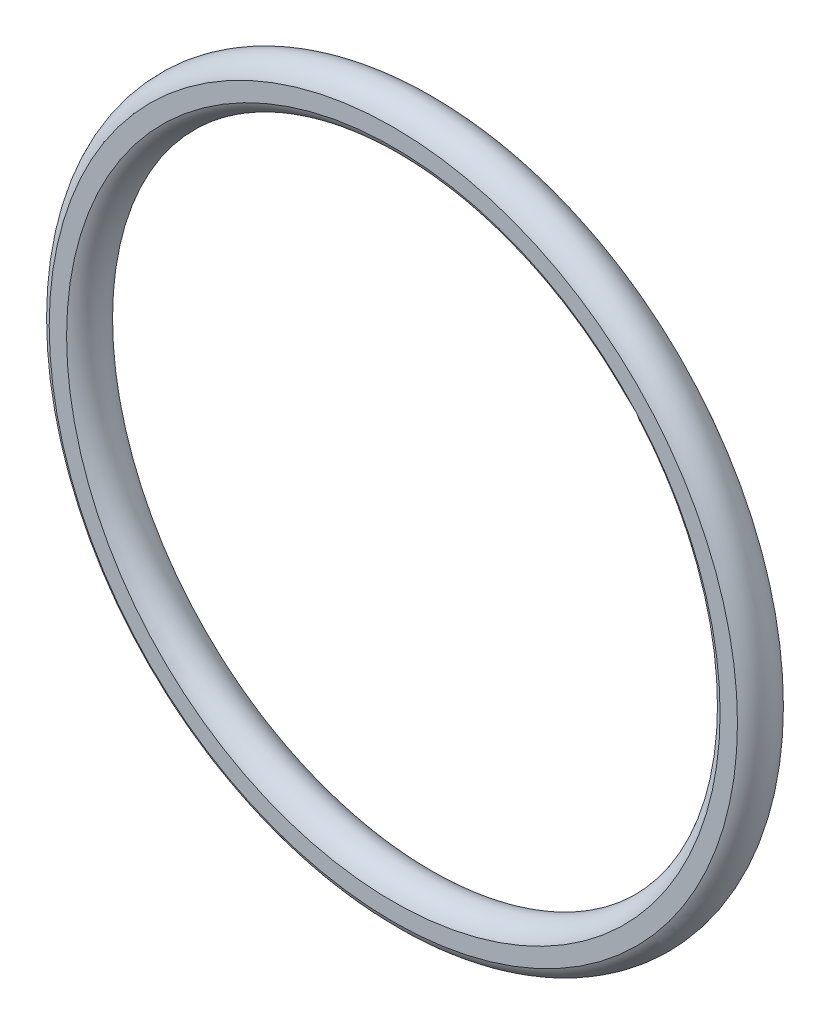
from build123d import *

# Parameters (mm, degrees)
SKETCH1_R          = 1.7653
SKETCH3_R          = 31.570207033
CUT_EXTRUDE1_DEPTH = 0.127


with BuildPart() as part:
    # Sketch1 → Revolve1 (revolve)
    with BuildSketch(Plane(origin=(0, 0, 0), x_dir=(0, -1, 0), z_dir=(1, 0, 0)), mode=Mode.PRIVATE) as revolve1_sk:
        with Locations((25.3746, 0)):
            Circle(SKETCH1_R)
    revolve(revolve1_sk.sketch.rotate(Axis((0, 0, 1.7653), (0, 0, -1)), 270), axis=Axis((0, 0, 1.7653), (0, 0, -1)))

    # Sketch3 → Cut-Extrude1 (cut)
    with BuildSketch(Plane.XY.offset(1.7653)):
        Circle(SKETCH3_R)
    extrude(amount=-CUT_EXTRUDE1_DEPTH, mode=Mode.SUBTRACT)


solid = part.part
